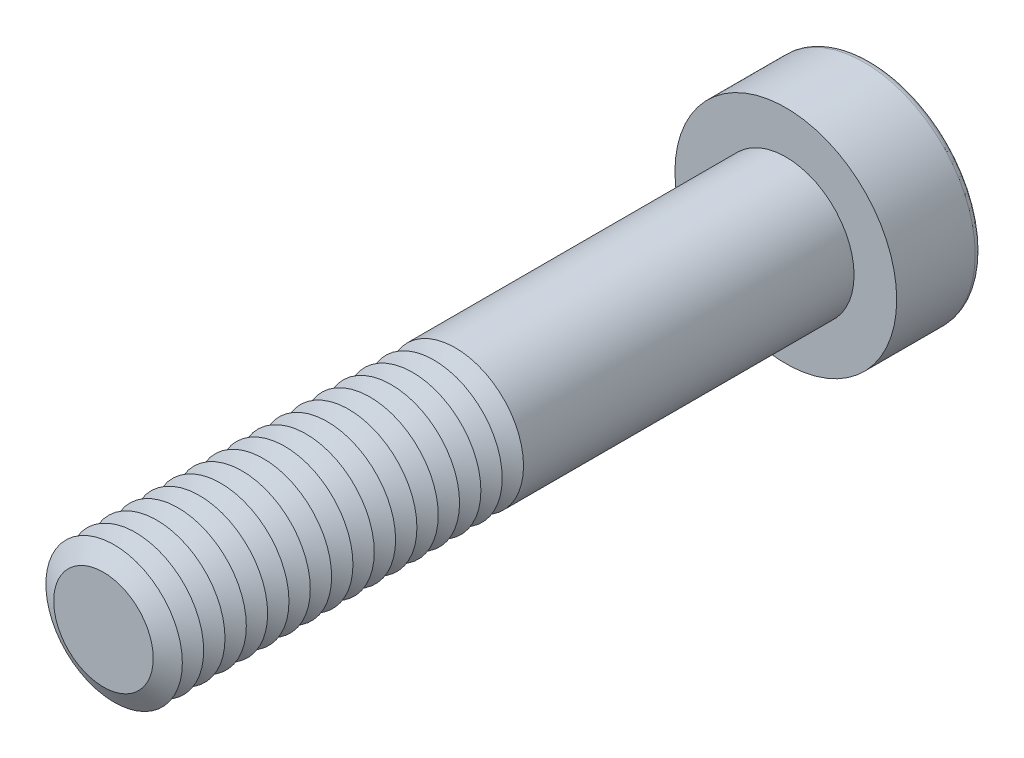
ISO-10303-21;
HEADER;
FILE_DESCRIPTION(('STEP AP214'),'2;1');
FILE_NAME('part.step','',(''),(''),'','','');
FILE_SCHEMA(('AUTOMOTIVE_DESIGN { 1 0 10303 214 1 1 1 1 }'));
ENDSEC;
DATA;
#1=APPLICATION_CONTEXT('core data for automotive mechanical design processes');
#2=APPLICATION_PROTOCOL_DEFINITION('international standard','automotive_design',2000,#1);
#3=PRODUCT_CONTEXT('',#1,'mechanical');
#4=PRODUCT('Part','Part','',(#3));
#5=PRODUCT_RELATED_PRODUCT_CATEGORY('part','',(#4));
#6=PRODUCT_DEFINITION_FORMATION('','',#4);
#7=PRODUCT_DEFINITION_CONTEXT('part definition',#1,'design');
#8=PRODUCT_DEFINITION('design','',#6,#7);
#9=PRODUCT_DEFINITION_SHAPE('','',#8);
#10=(LENGTH_UNIT() NAMED_UNIT(*) SI_UNIT(.MILLI.,.METRE.));
#11=(NAMED_UNIT(*) PLANE_ANGLE_UNIT() SI_UNIT($,.RADIAN.));
#12=(NAMED_UNIT(*) SI_UNIT($,.STERADIAN.) SOLID_ANGLE_UNIT());
#13=UNCERTAINTY_MEASURE_WITH_UNIT(LENGTH_MEASURE(1.E-05),#10,'distance_accuracy_value','');
#14=(GEOMETRIC_REPRESENTATION_CONTEXT(3) GLOBAL_UNCERTAINTY_ASSIGNED_CONTEXT((#13)) GLOBAL_UNIT_ASSIGNED_CONTEXT((#10,
#11,#12)) REPRESENTATION_CONTEXT('',''));
#15=CARTESIAN_POINT('',(0.,0.,0.));
#16=DIRECTION('',(0.,0.,1.));
#17=DIRECTION('',(1.,0.,0.));
#18=AXIS2_PLACEMENT_3D('',#15,#16,#17);
#19=CARTESIAN_POINT('',(0.,0.,35.625));
#20=DIRECTION('',(0.,0.,1.));
#21=DIRECTION('',(1.,0.,0.));
#22=AXIS2_PLACEMENT_3D('',#19,#20,#21);
#23=CONICAL_SURFACE('',#22,4.,1.0471975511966);
#24=CARTESIAN_POINT('',(0.,0.,35.));
#25=DIRECTION('',(0.,0.,1.));
#26=DIRECTION('',(1.,0.,0.));
#27=AXIS2_PLACEMENT_3D('',#24,#25,#26);
#28=CIRCLE('',#27,2.91746824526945);
#29=CARTESIAN_POINT('',(2.91746824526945,0.,35.));
#30=VERTEX_POINT('',#29);
#31=EDGE_CURVE('E312',#30,#30,#28,.T.);
#32=ORIENTED_EDGE('',*,*,#31,.T.);
#33=EDGE_LOOP('',(#32));
#34=FACE_BOUND('',#33,.T.);
#35=CARTESIAN_POINT('',(0.,0.,35.625));
#36=DIRECTION('',(0.,0.,1.));
#37=DIRECTION('',(1.,0.,0.));
#38=AXIS2_PLACEMENT_3D('',#35,#36,#37);
#39=CIRCLE('',#38,4.);
#40=CARTESIAN_POINT('',(4.,0.,35.625));
#41=VERTEX_POINT('',#40);
#42=EDGE_CURVE('E315',#41,#41,#39,.T.);
#43=ORIENTED_EDGE('',*,*,#42,.F.);
#44=EDGE_LOOP('',(#43));
#45=FACE_BOUND('',#44,.T.);
#46=ADVANCED_FACE('F39',(#34,#45),#23,.T.);
#47=CARTESIAN_POINT('',(0.,0.,35.));
#48=DIRECTION('',(0.,0.,-1.));
#49=DIRECTION('',(-1.,0.,0.));
#50=AXIS2_PLACEMENT_3D('',#47,#48,#49);
#51=CONICAL_SURFACE('',#50,2.91746824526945,1.0471975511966);
#52=CARTESIAN_POINT('',(0.,0.,34.375));
#53=DIRECTION('',(0.,0.,1.));
#54=DIRECTION('',(1.,0.,0.));
#55=AXIS2_PLACEMENT_3D('',#52,#53,#54);
#56=CIRCLE('',#55,4.);
#57=CARTESIAN_POINT('',(4.,0.,34.375));
#58=VERTEX_POINT('',#57);
#59=EDGE_CURVE('E323',#58,#58,#56,.T.);
#60=ORIENTED_EDGE('',*,*,#59,.T.);
#61=EDGE_LOOP('',(#60));
#62=FACE_BOUND('',#61,.T.);
#63=ORIENTED_EDGE('',*,*,#31,.F.);
#64=EDGE_LOOP('',(#63));
#65=FACE_BOUND('',#64,.T.);
#66=ADVANCED_FACE('F245',(#62,#65),#51,.T.);
#67=CARTESIAN_POINT('',(0.,0.,40.));
#68=DIRECTION('',(0.,0.,1.));
#69=DIRECTION('',(1.,0.,0.));
#70=AXIS2_PLACEMENT_3D('',#67,#68,#69);
#71=PLANE('',#70);
#72=CARTESIAN_POINT('',(0.,0.,40.));
#73=DIRECTION('',(0.,0.,1.));
#74=DIRECTION('',(1.,0.,0.));
#75=AXIS2_PLACEMENT_3D('',#72,#73,#74);
#76=CIRCLE('',#75,2.91746824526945);
#77=CARTESIAN_POINT('',(2.91746824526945,0.,40.));
#78=VERTEX_POINT('',#77);
#79=EDGE_CURVE('E174',#78,#78,#76,.T.);
#80=ORIENTED_EDGE('',*,*,#79,.T.);
#81=EDGE_LOOP('',(#80));
#82=FACE_BOUND('',#81,.T.);
#83=ADVANCED_FACE('F251',(#82),#71,.T.);
#84=CARTESIAN_POINT('',(0.,0.,40.));
#85=DIRECTION('',(0.,0.,-1.));
#86=DIRECTION('',(-1.,0.,0.));
#87=AXIS2_PLACEMENT_3D('',#84,#85,#86);
#88=CONICAL_SURFACE('',#87,2.91746824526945,1.0471975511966);
#89=CARTESIAN_POINT('',(0.,0.,39.375));
#90=DIRECTION('',(0.,0.,1.));
#91=DIRECTION('',(1.,0.,0.));
#92=AXIS2_PLACEMENT_3D('',#89,#90,#91);
#93=CIRCLE('',#92,4.);
#94=CARTESIAN_POINT('',(4.,0.,39.375));
#95=VERTEX_POINT('',#94);
#96=EDGE_CURVE('E291',#95,#95,#93,.T.);
#97=ORIENTED_EDGE('',*,*,#96,.T.);
#98=EDGE_LOOP('',(#97));
#99=FACE_BOUND('',#98,.T.);
#100=ORIENTED_EDGE('',*,*,#79,.F.);
#101=EDGE_LOOP('',(#100));
#102=FACE_BOUND('',#101,.T.);
#103=ADVANCED_FACE('F199',(#99,#102),#88,.T.);
#104=CARTESIAN_POINT('',(0.,0.,39.375));
#105=DIRECTION('',(0.,0.,1.));
#106=DIRECTION('',(1.,0.,0.));
#107=AXIS2_PLACEMENT_3D('',#104,#105,#106);
#108=CONICAL_SURFACE('',#107,4.,1.0471975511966);
#109=CARTESIAN_POINT('',(0.,0.,38.75));
#110=DIRECTION('',(0.,0.,1.));
#111=DIRECTION('',(1.,0.,0.));
#112=AXIS2_PLACEMENT_3D('',#109,#110,#111);
#113=CIRCLE('',#112,2.91746824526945);
#114=CARTESIAN_POINT('',(2.91746824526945,0.,38.75));
#115=VERTEX_POINT('',#114);
#116=EDGE_CURVE('E288',#115,#115,#113,.T.);
#117=ORIENTED_EDGE('',*,*,#116,.T.);
#118=EDGE_LOOP('',(#117));
#119=FACE_BOUND('',#118,.T.);
#120=ORIENTED_EDGE('',*,*,#96,.F.);
#121=EDGE_LOOP('',(#120));
#122=FACE_BOUND('',#121,.T.);
#123=ADVANCED_FACE('F277',(#119,#122),#108,.T.);
#124=CARTESIAN_POINT('',(0.,0.,38.75));
#125=DIRECTION('',(0.,0.,-1.));
#126=DIRECTION('',(-1.,0.,0.));
#127=AXIS2_PLACEMENT_3D('',#124,#125,#126);
#128=CONICAL_SURFACE('',#127,2.91746824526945,1.0471975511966);
#129=CARTESIAN_POINT('',(0.,0.,38.125));
#130=DIRECTION('',(0.,0.,1.));
#131=DIRECTION('',(1.,0.,0.));
#132=AXIS2_PLACEMENT_3D('',#129,#130,#131);
#133=CIRCLE('',#132,4.);
#134=CARTESIAN_POINT('',(4.,0.,38.125));
#135=VERTEX_POINT('',#134);
#136=EDGE_CURVE('E299',#135,#135,#133,.T.);
#137=ORIENTED_EDGE('',*,*,#136,.T.);
#138=EDGE_LOOP('',(#137));
#139=FACE_BOUND('',#138,.T.);
#140=ORIENTED_EDGE('',*,*,#116,.F.);
#141=EDGE_LOOP('',(#140));
#142=FACE_BOUND('',#141,.T.);
#143=ADVANCED_FACE('F274',(#139,#142),#128,.T.);
#144=CARTESIAN_POINT('',(0.,0.,38.125));
#145=DIRECTION('',(0.,0.,1.));
#146=DIRECTION('',(1.,0.,0.));
#147=AXIS2_PLACEMENT_3D('',#144,#145,#146);
#148=CONICAL_SURFACE('',#147,4.,1.0471975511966);
#149=CARTESIAN_POINT('',(0.,0.,37.5));
#150=DIRECTION('',(0.,0.,1.));
#151=DIRECTION('',(1.,0.,0.));
#152=AXIS2_PLACEMENT_3D('',#149,#150,#151);
#153=CIRCLE('',#152,2.91746824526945);
#154=CARTESIAN_POINT('',(2.91746824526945,0.,37.5));
#155=VERTEX_POINT('',#154);
#156=EDGE_CURVE('E293',#155,#155,#153,.T.);
#157=ORIENTED_EDGE('',*,*,#156,.T.);
#158=EDGE_LOOP('',(#157));
#159=FACE_BOUND('',#158,.T.);
#160=ORIENTED_EDGE('',*,*,#136,.F.);
#161=EDGE_LOOP('',(#160));
#162=FACE_BOUND('',#161,.T.);
#163=ADVANCED_FACE('F270',(#159,#162),#148,.T.);
#164=CARTESIAN_POINT('',(0.,0.,37.5));
#165=DIRECTION('',(0.,0.,-1.));
#166=DIRECTION('',(-1.,0.,0.));
#167=AXIS2_PLACEMENT_3D('',#164,#165,#166);
#168=CONICAL_SURFACE('',#167,2.91746824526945,1.0471975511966);
#169=CARTESIAN_POINT('',(0.,0.,36.875));
#170=DIRECTION('',(0.,0.,1.));
#171=DIRECTION('',(1.,0.,0.));
#172=AXIS2_PLACEMENT_3D('',#169,#170,#171);
#173=CIRCLE('',#172,4.);
#174=CARTESIAN_POINT('',(4.,0.,36.875));
#175=VERTEX_POINT('',#174);
#176=EDGE_CURVE('E309',#175,#175,#173,.T.);
#177=ORIENTED_EDGE('',*,*,#176,.T.);
#178=EDGE_LOOP('',(#177));
#179=FACE_BOUND('',#178,.T.);
#180=ORIENTED_EDGE('',*,*,#156,.F.);
#181=EDGE_LOOP('',(#180));
#182=FACE_BOUND('',#181,.T.);
#183=ADVANCED_FACE('F266',(#179,#182),#168,.T.);
#184=CARTESIAN_POINT('',(0.,0.,36.875));
#185=DIRECTION('',(0.,0.,1.));
#186=DIRECTION('',(1.,0.,0.));
#187=AXIS2_PLACEMENT_3D('',#184,#185,#186);
#188=CONICAL_SURFACE('',#187,4.,1.0471975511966);
#189=CARTESIAN_POINT('',(0.,0.,36.25));
#190=DIRECTION('',(0.,0.,1.));
#191=DIRECTION('',(1.,0.,0.));
#192=AXIS2_PLACEMENT_3D('',#189,#190,#191);
#193=CIRCLE('',#192,2.91746824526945);
#194=CARTESIAN_POINT('',(2.91746824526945,0.,36.25));
#195=VERTEX_POINT('',#194);
#196=EDGE_CURVE('E305',#195,#195,#193,.T.);
#197=ORIENTED_EDGE('',*,*,#196,.T.);
#198=EDGE_LOOP('',(#197));
#199=FACE_BOUND('',#198,.T.);
#200=ORIENTED_EDGE('',*,*,#176,.F.);
#201=EDGE_LOOP('',(#200));
#202=FACE_BOUND('',#201,.T.);
#203=ADVANCED_FACE('F262',(#199,#202),#188,.T.);
#204=CARTESIAN_POINT('',(0.,0.,36.25));
#205=DIRECTION('',(0.,0.,-1.));
#206=DIRECTION('',(-1.,0.,0.));
#207=AXIS2_PLACEMENT_3D('',#204,#205,#206);
#208=CONICAL_SURFACE('',#207,2.91746824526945,1.0471975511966);
#209=ORIENTED_EDGE('',*,*,#42,.T.);
#210=EDGE_LOOP('',(#209));
#211=FACE_BOUND('',#210,.T.);
#212=ORIENTED_EDGE('',*,*,#196,.F.);
#213=EDGE_LOOP('',(#212));
#214=FACE_BOUND('',#213,.T.);
#215=ADVANCED_FACE('F258',(#211,#214),#208,.T.);
#216=CARTESIAN_POINT('',(0.,0.,34.375));
#217=DIRECTION('',(0.,0.,1.));
#218=DIRECTION('',(1.,0.,0.));
#219=AXIS2_PLACEMENT_3D('',#216,#217,#218);
#220=CONICAL_SURFACE('',#219,4.,1.0471975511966);
#221=CARTESIAN_POINT('',(0.,0.,33.75));
#222=DIRECTION('',(0.,0.,1.));
#223=DIRECTION('',(1.,0.,0.));
#224=AXIS2_PLACEMENT_3D('',#221,#222,#223);
#225=CIRCLE('',#224,2.91746824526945);
#226=CARTESIAN_POINT('',(2.91746824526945,0.,33.75));
#227=VERTEX_POINT('',#226);
#228=EDGE_CURVE('E319',#227,#227,#225,.T.);
#229=ORIENTED_EDGE('',*,*,#228,.T.);
#230=EDGE_LOOP('',(#229));
#231=FACE_BOUND('',#230,.T.);
#232=ORIENTED_EDGE('',*,*,#59,.F.);
#233=EDGE_LOOP('',(#232));
#234=FACE_BOUND('',#233,.T.);
#235=ADVANCED_FACE('F261',(#231,#234),#220,.T.);
#236=CARTESIAN_POINT('',(0.,0.,33.75));
#237=DIRECTION('',(0.,0.,-1.));
#238=DIRECTION('',(-1.,0.,0.));
#239=AXIS2_PLACEMENT_3D('',#236,#237,#238);
#240=CONICAL_SURFACE('',#239,2.91746824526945,1.0471975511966);
#241=CARTESIAN_POINT('',(0.,0.,33.125));
#242=DIRECTION('',(0.,0.,1.));
#243=DIRECTION('',(1.,0.,0.));
#244=AXIS2_PLACEMENT_3D('',#241,#242,#243);
#245=CIRCLE('',#244,4.);
#246=CARTESIAN_POINT('',(4.,0.,33.125));
#247=VERTEX_POINT('',#246);
#248=EDGE_CURVE('E331',#247,#247,#245,.T.);
#249=ORIENTED_EDGE('',*,*,#248,.T.);
#250=EDGE_LOOP('',(#249));
#251=FACE_BOUND('',#250,.T.);
#252=ORIENTED_EDGE('',*,*,#228,.F.);
#253=EDGE_LOOP('',(#252));
#254=FACE_BOUND('',#253,.T.);
#255=ADVANCED_FACE('F511',(#251,#254),#240,.T.);
#256=CARTESIAN_POINT('',(0.,0.,33.125));
#257=DIRECTION('',(0.,0.,1.));
#258=DIRECTION('',(1.,0.,0.));
#259=AXIS2_PLACEMENT_3D('',#256,#257,#258);
#260=CONICAL_SURFACE('',#259,4.,1.0471975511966);
#261=CARTESIAN_POINT('',(0.,0.,32.5));
#262=DIRECTION('',(0.,0.,1.));
#263=DIRECTION('',(1.,0.,0.));
#264=AXIS2_PLACEMENT_3D('',#261,#262,#263);
#265=CIRCLE('',#264,2.91746824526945);
#266=CARTESIAN_POINT('',(2.91746824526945,0.,32.5));
#267=VERTEX_POINT('',#266);
#268=EDGE_CURVE('E327',#267,#267,#265,.T.);
#269=ORIENTED_EDGE('',*,*,#268,.T.);
#270=EDGE_LOOP('',(#269));
#271=FACE_BOUND('',#270,.T.);
#272=ORIENTED_EDGE('',*,*,#248,.F.);
#273=EDGE_LOOP('',(#272));
#274=FACE_BOUND('',#273,.T.);
#275=ADVANCED_FACE('F507',(#271,#274),#260,.T.);
#276=CARTESIAN_POINT('',(0.,0.,32.5));
#277=DIRECTION('',(0.,0.,-1.));
#278=DIRECTION('',(-1.,0.,0.));
#279=AXIS2_PLACEMENT_3D('',#276,#277,#278);
#280=CONICAL_SURFACE('',#279,2.91746824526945,1.0471975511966);
#281=CARTESIAN_POINT('',(0.,0.,31.875));
#282=DIRECTION('',(0.,0.,1.));
#283=DIRECTION('',(1.,0.,0.));
#284=AXIS2_PLACEMENT_3D('',#281,#282,#283);
#285=CIRCLE('',#284,4.);
#286=CARTESIAN_POINT('',(4.,0.,31.875));
#287=VERTEX_POINT('',#286);
#288=EDGE_CURVE('E338',#287,#287,#285,.T.);
#289=ORIENTED_EDGE('',*,*,#288,.T.);
#290=EDGE_LOOP('',(#289));
#291=FACE_BOUND('',#290,.T.);
#292=ORIENTED_EDGE('',*,*,#268,.F.);
#293=EDGE_LOOP('',(#292));
#294=FACE_BOUND('',#293,.T.);
#295=ADVANCED_FACE('F503',(#291,#294),#280,.T.);
#296=CARTESIAN_POINT('',(0.,0.,31.875));
#297=DIRECTION('',(0.,0.,1.));
#298=DIRECTION('',(1.,0.,0.));
#299=AXIS2_PLACEMENT_3D('',#296,#297,#298);
#300=CONICAL_SURFACE('',#299,4.,1.0471975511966);
#301=CARTESIAN_POINT('',(0.,0.,31.25));
#302=DIRECTION('',(0.,0.,1.));
#303=DIRECTION('',(1.,0.,0.));
#304=AXIS2_PLACEMENT_3D('',#301,#302,#303);
#305=CIRCLE('',#304,2.91746824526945);
#306=CARTESIAN_POINT('',(2.91746824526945,0.,31.25));
#307=VERTEX_POINT('',#306);
#308=EDGE_CURVE('E334',#307,#307,#305,.T.);
#309=ORIENTED_EDGE('',*,*,#308,.T.);
#310=EDGE_LOOP('',(#309));
#311=FACE_BOUND('',#310,.T.);
#312=ORIENTED_EDGE('',*,*,#288,.F.);
#313=EDGE_LOOP('',(#312));
#314=FACE_BOUND('',#313,.T.);
#315=ADVANCED_FACE('F499',(#311,#314),#300,.T.);
#316=CARTESIAN_POINT('',(0.,0.,31.25));
#317=DIRECTION('',(0.,0.,-1.));
#318=DIRECTION('',(-1.,0.,0.));
#319=AXIS2_PLACEMENT_3D('',#316,#317,#318);
#320=CONICAL_SURFACE('',#319,2.91746824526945,1.0471975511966);
#321=CARTESIAN_POINT('',(0.,0.,30.625));
#322=DIRECTION('',(0.,0.,1.));
#323=DIRECTION('',(1.,0.,0.));
#324=AXIS2_PLACEMENT_3D('',#321,#322,#323);
#325=CIRCLE('',#324,4.);
#326=CARTESIAN_POINT('',(4.,0.,30.625));
#327=VERTEX_POINT('',#326);
#328=EDGE_CURVE('E346',#327,#327,#325,.T.);
#329=ORIENTED_EDGE('',*,*,#328,.T.);
#330=EDGE_LOOP('',(#329));
#331=FACE_BOUND('',#330,.T.);
#332=ORIENTED_EDGE('',*,*,#308,.F.);
#333=EDGE_LOOP('',(#332));
#334=FACE_BOUND('',#333,.T.);
#335=ADVANCED_FACE('F495',(#331,#334),#320,.T.);
#336=CARTESIAN_POINT('',(0.,0.,30.625));
#337=DIRECTION('',(0.,0.,1.));
#338=DIRECTION('',(1.,0.,0.));
#339=AXIS2_PLACEMENT_3D('',#336,#337,#338);
#340=CONICAL_SURFACE('',#339,4.,1.0471975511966);
#341=CARTESIAN_POINT('',(0.,0.,30.));
#342=DIRECTION('',(0.,0.,1.));
#343=DIRECTION('',(1.,0.,0.));
#344=AXIS2_PLACEMENT_3D('',#341,#342,#343);
#345=CIRCLE('',#344,2.91746824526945);
#346=CARTESIAN_POINT('',(2.91746824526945,0.,30.));
#347=VERTEX_POINT('',#346);
#348=EDGE_CURVE('E342',#347,#347,#345,.T.);
#349=ORIENTED_EDGE('',*,*,#348,.T.);
#350=EDGE_LOOP('',(#349));
#351=FACE_BOUND('',#350,.T.);
#352=ORIENTED_EDGE('',*,*,#328,.F.);
#353=EDGE_LOOP('',(#352));
#354=FACE_BOUND('',#353,.T.);
#355=ADVANCED_FACE('F491',(#351,#354),#340,.T.);
#356=CARTESIAN_POINT('',(0.,0.,30.));
#357=DIRECTION('',(0.,0.,-1.));
#358=DIRECTION('',(-1.,0.,0.));
#359=AXIS2_PLACEMENT_3D('',#356,#357,#358);
#360=CONICAL_SURFACE('',#359,2.91746824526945,1.0471975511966);
#361=CARTESIAN_POINT('',(0.,0.,29.375));
#362=DIRECTION('',(0.,0.,1.));
#363=DIRECTION('',(1.,0.,0.));
#364=AXIS2_PLACEMENT_3D('',#361,#362,#363);
#365=CIRCLE('',#364,4.);
#366=CARTESIAN_POINT('',(4.,0.,29.375));
#367=VERTEX_POINT('',#366);
#368=EDGE_CURVE('E354',#367,#367,#365,.T.);
#369=ORIENTED_EDGE('',*,*,#368,.T.);
#370=EDGE_LOOP('',(#369));
#371=FACE_BOUND('',#370,.T.);
#372=ORIENTED_EDGE('',*,*,#348,.F.);
#373=EDGE_LOOP('',(#372));
#374=FACE_BOUND('',#373,.T.);
#375=ADVANCED_FACE('F487',(#371,#374),#360,.T.);
#376=CARTESIAN_POINT('',(0.,0.,29.375));
#377=DIRECTION('',(0.,0.,1.));
#378=DIRECTION('',(1.,0.,0.));
#379=AXIS2_PLACEMENT_3D('',#376,#377,#378);
#380=CONICAL_SURFACE('',#379,4.,1.0471975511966);
#381=CARTESIAN_POINT('',(0.,0.,28.75));
#382=DIRECTION('',(0.,0.,1.));
#383=DIRECTION('',(1.,0.,0.));
#384=AXIS2_PLACEMENT_3D('',#381,#382,#383);
#385=CIRCLE('',#384,2.91746824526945);
#386=CARTESIAN_POINT('',(2.91746824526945,0.,28.75));
#387=VERTEX_POINT('',#386);
#388=EDGE_CURVE('E350',#387,#387,#385,.T.);
#389=ORIENTED_EDGE('',*,*,#388,.T.);
#390=EDGE_LOOP('',(#389));
#391=FACE_BOUND('',#390,.T.);
#392=ORIENTED_EDGE('',*,*,#368,.F.);
#393=EDGE_LOOP('',(#392));
#394=FACE_BOUND('',#393,.T.);
#395=ADVANCED_FACE('F483',(#391,#394),#380,.T.);
#396=CARTESIAN_POINT('',(0.,0.,28.75));
#397=DIRECTION('',(0.,0.,-1.));
#398=DIRECTION('',(-1.,0.,0.));
#399=AXIS2_PLACEMENT_3D('',#396,#397,#398);
#400=CONICAL_SURFACE('',#399,2.91746824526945,1.0471975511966);
#401=CARTESIAN_POINT('',(0.,0.,28.125));
#402=DIRECTION('',(0.,0.,1.));
#403=DIRECTION('',(1.,0.,0.));
#404=AXIS2_PLACEMENT_3D('',#401,#402,#403);
#405=CIRCLE('',#404,4.);
#406=CARTESIAN_POINT('',(4.,0.,28.125));
#407=VERTEX_POINT('',#406);
#408=EDGE_CURVE('E362',#407,#407,#405,.T.);
#409=ORIENTED_EDGE('',*,*,#408,.T.);
#410=EDGE_LOOP('',(#409));
#411=FACE_BOUND('',#410,.T.);
#412=ORIENTED_EDGE('',*,*,#388,.F.);
#413=EDGE_LOOP('',(#412));
#414=FACE_BOUND('',#413,.T.);
#415=ADVANCED_FACE('F479',(#411,#414),#400,.T.);
#416=CARTESIAN_POINT('',(0.,0.,28.125));
#417=DIRECTION('',(0.,0.,1.));
#418=DIRECTION('',(1.,0.,0.));
#419=AXIS2_PLACEMENT_3D('',#416,#417,#418);
#420=CONICAL_SURFACE('',#419,4.,1.0471975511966);
#421=CARTESIAN_POINT('',(0.,0.,27.5));
#422=DIRECTION('',(0.,0.,1.));
#423=DIRECTION('',(1.,0.,0.));
#424=AXIS2_PLACEMENT_3D('',#421,#422,#423);
#425=CIRCLE('',#424,2.91746824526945);
#426=CARTESIAN_POINT('',(2.91746824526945,0.,27.5));
#427=VERTEX_POINT('',#426);
#428=EDGE_CURVE('E358',#427,#427,#425,.T.);
#429=ORIENTED_EDGE('',*,*,#428,.T.);
#430=EDGE_LOOP('',(#429));
#431=FACE_BOUND('',#430,.T.);
#432=ORIENTED_EDGE('',*,*,#408,.F.);
#433=EDGE_LOOP('',(#432));
#434=FACE_BOUND('',#433,.T.);
#435=ADVANCED_FACE('F475',(#431,#434),#420,.T.);
#436=CARTESIAN_POINT('',(0.,0.,27.5));
#437=DIRECTION('',(0.,0.,-1.));
#438=DIRECTION('',(-1.,0.,0.));
#439=AXIS2_PLACEMENT_3D('',#436,#437,#438);
#440=CONICAL_SURFACE('',#439,2.91746824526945,1.0471975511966);
#441=CARTESIAN_POINT('',(0.,0.,26.875));
#442=DIRECTION('',(0.,0.,1.));
#443=DIRECTION('',(1.,0.,0.));
#444=AXIS2_PLACEMENT_3D('',#441,#442,#443);
#445=CIRCLE('',#444,4.);
#446=CARTESIAN_POINT('',(4.,0.,26.875));
#447=VERTEX_POINT('',#446);
#448=EDGE_CURVE('E370',#447,#447,#445,.T.);
#449=ORIENTED_EDGE('',*,*,#448,.T.);
#450=EDGE_LOOP('',(#449));
#451=FACE_BOUND('',#450,.T.);
#452=ORIENTED_EDGE('',*,*,#428,.F.);
#453=EDGE_LOOP('',(#452));
#454=FACE_BOUND('',#453,.T.);
#455=ADVANCED_FACE('F471',(#451,#454),#440,.T.);
#456=CARTESIAN_POINT('',(0.,0.,26.875));
#457=DIRECTION('',(0.,0.,1.));
#458=DIRECTION('',(1.,0.,0.));
#459=AXIS2_PLACEMENT_3D('',#456,#457,#458);
#460=CONICAL_SURFACE('',#459,4.,1.0471975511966);
#461=CARTESIAN_POINT('',(0.,0.,26.25));
#462=DIRECTION('',(0.,0.,1.));
#463=DIRECTION('',(1.,0.,0.));
#464=AXIS2_PLACEMENT_3D('',#461,#462,#463);
#465=CIRCLE('',#464,2.91746824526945);
#466=CARTESIAN_POINT('',(2.91746824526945,0.,26.25));
#467=VERTEX_POINT('',#466);
#468=EDGE_CURVE('E366',#467,#467,#465,.T.);
#469=ORIENTED_EDGE('',*,*,#468,.T.);
#470=EDGE_LOOP('',(#469));
#471=FACE_BOUND('',#470,.T.);
#472=ORIENTED_EDGE('',*,*,#448,.F.);
#473=EDGE_LOOP('',(#472));
#474=FACE_BOUND('',#473,.T.);
#475=ADVANCED_FACE('F467',(#471,#474),#460,.T.);
#476=CARTESIAN_POINT('',(0.,0.,26.25));
#477=DIRECTION('',(0.,0.,-1.));
#478=DIRECTION('',(-1.,0.,0.));
#479=AXIS2_PLACEMENT_3D('',#476,#477,#478);
#480=CONICAL_SURFACE('',#479,2.91746824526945,1.0471975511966);
#481=CARTESIAN_POINT('',(0.,0.,25.625));
#482=DIRECTION('',(0.,0.,1.));
#483=DIRECTION('',(1.,0.,0.));
#484=AXIS2_PLACEMENT_3D('',#481,#482,#483);
#485=CIRCLE('',#484,4.);
#486=CARTESIAN_POINT('',(4.,0.,25.625));
#487=VERTEX_POINT('',#486);
#488=EDGE_CURVE('E378',#487,#487,#485,.T.);
#489=ORIENTED_EDGE('',*,*,#488,.T.);
#490=EDGE_LOOP('',(#489));
#491=FACE_BOUND('',#490,.T.);
#492=ORIENTED_EDGE('',*,*,#468,.F.);
#493=EDGE_LOOP('',(#492));
#494=FACE_BOUND('',#493,.T.);
#495=ADVANCED_FACE('F463',(#491,#494),#480,.T.);
#496=CARTESIAN_POINT('',(0.,0.,25.625));
#497=DIRECTION('',(0.,0.,1.));
#498=DIRECTION('',(1.,0.,0.));
#499=AXIS2_PLACEMENT_3D('',#496,#497,#498);
#500=CONICAL_SURFACE('',#499,4.,1.0471975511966);
#501=CARTESIAN_POINT('',(0.,0.,25.));
#502=DIRECTION('',(0.,0.,1.));
#503=DIRECTION('',(1.,0.,0.));
#504=AXIS2_PLACEMENT_3D('',#501,#502,#503);
#505=CIRCLE('',#504,2.91746824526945);
#506=CARTESIAN_POINT('',(2.91746824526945,0.,25.));
#507=VERTEX_POINT('',#506);
#508=EDGE_CURVE('E374',#507,#507,#505,.T.);
#509=ORIENTED_EDGE('',*,*,#508,.T.);
#510=EDGE_LOOP('',(#509));
#511=FACE_BOUND('',#510,.T.);
#512=ORIENTED_EDGE('',*,*,#488,.F.);
#513=EDGE_LOOP('',(#512));
#514=FACE_BOUND('',#513,.T.);
#515=ADVANCED_FACE('F459',(#511,#514),#500,.T.);
#516=CARTESIAN_POINT('',(0.,0.,25.));
#517=DIRECTION('',(0.,0.,-1.));
#518=DIRECTION('',(-1.,0.,0.));
#519=AXIS2_PLACEMENT_3D('',#516,#517,#518);
#520=CONICAL_SURFACE('',#519,2.91746824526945,1.0471975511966);
#521=CARTESIAN_POINT('',(0.,0.,24.375));
#522=DIRECTION('',(0.,0.,1.));
#523=DIRECTION('',(1.,0.,0.));
#524=AXIS2_PLACEMENT_3D('',#521,#522,#523);
#525=CIRCLE('',#524,4.);
#526=CARTESIAN_POINT('',(4.,0.,24.375));
#527=VERTEX_POINT('',#526);
#528=EDGE_CURVE('E386',#527,#527,#525,.T.);
#529=ORIENTED_EDGE('',*,*,#528,.T.);
#530=EDGE_LOOP('',(#529));
#531=FACE_BOUND('',#530,.T.);
#532=ORIENTED_EDGE('',*,*,#508,.F.);
#533=EDGE_LOOP('',(#532));
#534=FACE_BOUND('',#533,.T.);
#535=ADVANCED_FACE('F455',(#531,#534),#520,.T.);
#536=CARTESIAN_POINT('',(0.,0.,24.375));
#537=DIRECTION('',(0.,0.,1.));
#538=DIRECTION('',(1.,0.,0.));
#539=AXIS2_PLACEMENT_3D('',#536,#537,#538);
#540=CONICAL_SURFACE('',#539,4.,1.0471975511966);
#541=CARTESIAN_POINT('',(0.,0.,23.75));
#542=DIRECTION('',(0.,0.,1.));
#543=DIRECTION('',(1.,0.,0.));
#544=AXIS2_PLACEMENT_3D('',#541,#542,#543);
#545=CIRCLE('',#544,2.91746824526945);
#546=CARTESIAN_POINT('',(2.91746824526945,0.,23.75));
#547=VERTEX_POINT('',#546);
#548=EDGE_CURVE('E382',#547,#547,#545,.T.);
#549=ORIENTED_EDGE('',*,*,#548,.T.);
#550=EDGE_LOOP('',(#549));
#551=FACE_BOUND('',#550,.T.);
#552=ORIENTED_EDGE('',*,*,#528,.F.);
#553=EDGE_LOOP('',(#552));
#554=FACE_BOUND('',#553,.T.);
#555=ADVANCED_FACE('F451',(#551,#554),#540,.T.);
#556=CARTESIAN_POINT('',(0.,0.,23.75));
#557=DIRECTION('',(0.,0.,-1.));
#558=DIRECTION('',(-1.,0.,0.));
#559=AXIS2_PLACEMENT_3D('',#556,#557,#558);
#560=CONICAL_SURFACE('',#559,2.91746824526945,1.0471975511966);
#561=CARTESIAN_POINT('',(0.,0.,23.125));
#562=DIRECTION('',(0.,0.,1.));
#563=DIRECTION('',(1.,0.,0.));
#564=AXIS2_PLACEMENT_3D('',#561,#562,#563);
#565=CIRCLE('',#564,4.);
#566=CARTESIAN_POINT('',(4.,0.,23.125));
#567=VERTEX_POINT('',#566);
#568=EDGE_CURVE('E394',#567,#567,#565,.T.);
#569=ORIENTED_EDGE('',*,*,#568,.T.);
#570=EDGE_LOOP('',(#569));
#571=FACE_BOUND('',#570,.T.);
#572=ORIENTED_EDGE('',*,*,#548,.F.);
#573=EDGE_LOOP('',(#572));
#574=FACE_BOUND('',#573,.T.);
#575=ADVANCED_FACE('F447',(#571,#574),#560,.T.);
#576=CARTESIAN_POINT('',(0.,0.,23.125));
#577=DIRECTION('',(0.,0.,1.));
#578=DIRECTION('',(1.,0.,0.));
#579=AXIS2_PLACEMENT_3D('',#576,#577,#578);
#580=CONICAL_SURFACE('',#579,4.,1.0471975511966);
#581=CARTESIAN_POINT('',(0.,0.,22.5));
#582=DIRECTION('',(0.,0.,1.));
#583=DIRECTION('',(1.,0.,0.));
#584=AXIS2_PLACEMENT_3D('',#581,#582,#583);
#585=CIRCLE('',#584,2.91746824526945);
#586=CARTESIAN_POINT('',(2.91746824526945,0.,22.5));
#587=VERTEX_POINT('',#586);
#588=EDGE_CURVE('E390',#587,#587,#585,.T.);
#589=ORIENTED_EDGE('',*,*,#588,.T.);
#590=EDGE_LOOP('',(#589));
#591=FACE_BOUND('',#590,.T.);
#592=ORIENTED_EDGE('',*,*,#568,.F.);
#593=EDGE_LOOP('',(#592));
#594=FACE_BOUND('',#593,.T.);
#595=ADVANCED_FACE('F443',(#591,#594),#580,.T.);
#596=CARTESIAN_POINT('',(0.,0.,22.5));
#597=DIRECTION('',(0.,0.,-1.));
#598=DIRECTION('',(-1.,0.,0.));
#599=AXIS2_PLACEMENT_3D('',#596,#597,#598);
#600=CONICAL_SURFACE('',#599,2.91746824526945,1.0471975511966);
#601=CARTESIAN_POINT('',(0.,0.,21.875));
#602=DIRECTION('',(0.,0.,1.));
#603=DIRECTION('',(1.,0.,0.));
#604=AXIS2_PLACEMENT_3D('',#601,#602,#603);
#605=CIRCLE('',#604,4.);
#606=CARTESIAN_POINT('',(4.,0.,21.875));
#607=VERTEX_POINT('',#606);
#608=EDGE_CURVE('E402',#607,#607,#605,.T.);
#609=ORIENTED_EDGE('',*,*,#608,.T.);
#610=EDGE_LOOP('',(#609));
#611=FACE_BOUND('',#610,.T.);
#612=ORIENTED_EDGE('',*,*,#588,.F.);
#613=EDGE_LOOP('',(#612));
#614=FACE_BOUND('',#613,.T.);
#615=ADVANCED_FACE('F439',(#611,#614),#600,.T.);
#616=CARTESIAN_POINT('',(0.,0.,21.875));
#617=DIRECTION('',(0.,0.,1.));
#618=DIRECTION('',(1.,0.,0.));
#619=AXIS2_PLACEMENT_3D('',#616,#617,#618);
#620=CONICAL_SURFACE('',#619,4.,1.0471975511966);
#621=CARTESIAN_POINT('',(0.,0.,21.25));
#622=DIRECTION('',(0.,0.,1.));
#623=DIRECTION('',(1.,0.,0.));
#624=AXIS2_PLACEMENT_3D('',#621,#622,#623);
#625=CIRCLE('',#624,2.91746824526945);
#626=CARTESIAN_POINT('',(2.91746824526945,0.,21.25));
#627=VERTEX_POINT('',#626);
#628=EDGE_CURVE('E398',#627,#627,#625,.T.);
#629=ORIENTED_EDGE('',*,*,#628,.T.);
#630=EDGE_LOOP('',(#629));
#631=FACE_BOUND('',#630,.T.);
#632=ORIENTED_EDGE('',*,*,#608,.F.);
#633=EDGE_LOOP('',(#632));
#634=FACE_BOUND('',#633,.T.);
#635=ADVANCED_FACE('F434',(#631,#634),#620,.T.);
#636=CARTESIAN_POINT('',(0.,0.,21.25));
#637=DIRECTION('',(0.,0.,-1.));
#638=DIRECTION('',(-1.,0.,0.));
#639=AXIS2_PLACEMENT_3D('',#636,#637,#638);
#640=CONICAL_SURFACE('',#639,2.91746824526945,1.0471975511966);
#641=CARTESIAN_POINT('',(0.,0.,20.625));
#642=DIRECTION('',(0.,0.,1.));
#643=DIRECTION('',(1.,0.,0.));
#644=AXIS2_PLACEMENT_3D('',#641,#642,#643);
#645=CIRCLE('',#644,4.);
#646=CARTESIAN_POINT('',(4.,0.,20.625));
#647=VERTEX_POINT('',#646);
#648=EDGE_CURVE('E414',#647,#647,#645,.T.);
#649=ORIENTED_EDGE('',*,*,#648,.T.);
#650=EDGE_LOOP('',(#649));
#651=FACE_BOUND('',#650,.T.);
#652=ORIENTED_EDGE('',*,*,#628,.F.);
#653=EDGE_LOOP('',(#652));
#654=FACE_BOUND('',#653,.T.);
#655=ADVANCED_FACE('F420',(#651,#654),#640,.T.);
#656=CARTESIAN_POINT('',(0.,0.,20.625));
#657=DIRECTION('',(0.,0.,1.));
#658=DIRECTION('',(1.,0.,0.));
#659=AXIS2_PLACEMENT_3D('',#656,#657,#658);
#660=CONICAL_SURFACE('',#659,4.,1.0471975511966);
#661=CARTESIAN_POINT('',(0.,0.,20.));
#662=DIRECTION('',(0.,0.,1.));
#663=DIRECTION('',(1.,0.,0.));
#664=AXIS2_PLACEMENT_3D('',#661,#662,#663);
#665=CIRCLE('',#664,2.91746824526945);
#666=CARTESIAN_POINT('',(2.91746824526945,0.,20.));
#667=VERTEX_POINT('',#666);
#668=EDGE_CURVE('E406',#667,#667,#665,.T.);
#669=ORIENTED_EDGE('',*,*,#668,.T.);
#670=EDGE_LOOP('',(#669));
#671=FACE_BOUND('',#670,.T.);
#672=ORIENTED_EDGE('',*,*,#648,.F.);
#673=EDGE_LOOP('',(#672));
#674=FACE_BOUND('',#673,.T.);
#675=ADVANCED_FACE('F423',(#671,#674),#660,.T.);
#676=CARTESIAN_POINT('',(0.,0.,20.));
#677=DIRECTION('',(0.,0.,-1.));
#678=DIRECTION('',(-1.,0.,0.));
#679=AXIS2_PLACEMENT_3D('',#676,#677,#678);
#680=CONICAL_SURFACE('',#679,2.91746824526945,1.0471975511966);
#681=CARTESIAN_POINT('',(0.,0.,19.375));
#682=DIRECTION('',(0.,0.,1.));
#683=DIRECTION('',(1.,0.,0.));
#684=AXIS2_PLACEMENT_3D('',#681,#682,#683);
#685=CIRCLE('',#684,4.);
#686=CARTESIAN_POINT('',(4.,0.,19.375));
#687=VERTEX_POINT('',#686);
#688=EDGE_CURVE('E410',#687,#687,#685,.T.);
#689=ORIENTED_EDGE('',*,*,#688,.T.);
#690=EDGE_LOOP('',(#689));
#691=FACE_BOUND('',#690,.T.);
#692=ORIENTED_EDGE('',*,*,#668,.F.);
#693=EDGE_LOOP('',(#692));
#694=FACE_BOUND('',#693,.T.);
#695=ADVANCED_FACE('F425',(#691,#694),#680,.T.);
#696=CARTESIAN_POINT('',(0.,0.,-1.25));
#697=DIRECTION('',(0.,0.,-1.));
#698=DIRECTION('',(-1.,0.,0.));
#699=AXIS2_PLACEMENT_3D('',#696,#697,#698);
#700=CONICAL_SURFACE('',#699,2.5,1.0471975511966);
#701=CARTESIAN_POINT('',(0.,0.,0.193375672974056));
#702=VERTEX_POINT('',#701);
#703=VERTEX_LOOP('',#702);
#704=FACE_BOUND('',#703,.T.);
#705=CARTESIAN_POINT('',(0.,0.,-1.25));
#706=DIRECTION('',(0.,0.,-1.));
#707=DIRECTION('',(-1.,0.,0.));
#708=AXIS2_PLACEMENT_3D('',#705,#706,#707);
#709=CIRCLE('',#708,2.5);
#710=CARTESIAN_POINT('',(-2.1650635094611,1.25,-1.25));
#711=VERTEX_POINT('',#710);
#712=CARTESIAN_POINT('',(0.,2.5,-1.25));
#713=VERTEX_POINT('',#712);
#714=EDGE_CURVE('E149',#711,#713,#709,.T.);
#715=ORIENTED_EDGE('',*,*,#714,.T.);
#716=CARTESIAN_POINT('',(0.,0.,-1.25));
#717=DIRECTION('',(0.,0.,-1.));
#718=DIRECTION('',(-1.,0.,0.));
#719=AXIS2_PLACEMENT_3D('',#716,#717,#718);
#720=CIRCLE('',#719,2.5);
#721=CARTESIAN_POINT('',(2.1650635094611,1.25,-1.25));
#722=VERTEX_POINT('',#721);
#723=EDGE_CURVE('E54',#713,#722,#720,.T.);
#724=ORIENTED_EDGE('',*,*,#723,.T.);
#725=CARTESIAN_POINT('',(2.1650635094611,-1.25,-1.25));
#726=VERTEX_POINT('',#725);
#727=EDGE_CURVE('E1025',#722,#726,#720,.T.);
#728=ORIENTED_EDGE('',*,*,#727,.T.);
#729=CARTESIAN_POINT('',(0.,-2.5,-1.25));
#730=VERTEX_POINT('',#729);
#731=EDGE_CURVE('E1023',#726,#730,#720,.T.);
#732=ORIENTED_EDGE('',*,*,#731,.T.);
#733=CARTESIAN_POINT('',(-2.1650635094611,-1.25,-1.25));
#734=VERTEX_POINT('',#733);
#735=EDGE_CURVE('E1018',#730,#734,#720,.T.);
#736=ORIENTED_EDGE('',*,*,#735,.T.);
#737=EDGE_CURVE('E1016',#734,#711,#720,.T.);
#738=ORIENTED_EDGE('',*,*,#737,.T.);
#739=EDGE_LOOP('',(#715,#724,#728,#732,#736,#738));
#740=FACE_BOUND('',#739,.T.);
#741=ADVANCED_FACE('F201',(#704,#740),#700,.F.);
#742=CARTESIAN_POINT('',(0.,0.,-1.25));
#743=DIRECTION('',(0.,0.,-1.));
#744=DIRECTION('',(-1.,0.,0.));
#745=AXIS2_PLACEMENT_3D('',#742,#743,#744);
#746=PLANE('',#745);
#747=ORIENTED_EDGE('',*,*,#723,.F.);
#748=DIRECTION('',(1.,0.,0.));
#749=VECTOR('',#748,1.);
#750=CARTESIAN_POINT('',(-1.44337567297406,2.5,-1.25));
#751=LINE('',#750,#749);
#752=CARTESIAN_POINT('',(1.44337567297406,2.5,-1.25));
#753=VERTEX_POINT('',#752);
#754=EDGE_CURVE('E1065',#713,#753,#751,.T.);
#755=ORIENTED_EDGE('',*,*,#754,.T.);
#756=DIRECTION('',(0.5,-0.866025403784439,0.));
#757=VECTOR('',#756,1.);
#758=CARTESIAN_POINT('',(1.44337567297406,2.5,-1.25));
#759=LINE('',#758,#757);
#760=EDGE_CURVE('E155',#753,#722,#759,.T.);
#761=ORIENTED_EDGE('',*,*,#760,.T.);
#762=EDGE_LOOP('',(#747,#755,#761));
#763=FACE_BOUND('',#762,.T.);
#764=ADVANCED_FACE('F606',(#763),#746,.T.);
#765=ORIENTED_EDGE('',*,*,#727,.F.);
#766=CARTESIAN_POINT('',(2.88675134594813,0.,-1.25));
#767=VERTEX_POINT('',#766);
#768=EDGE_CURVE('E1064',#722,#767,#759,.T.);
#769=ORIENTED_EDGE('',*,*,#768,.T.);
#770=DIRECTION('',(-0.5,-0.866025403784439,0.));
#771=VECTOR('',#770,1.);
#772=CARTESIAN_POINT('',(2.88675134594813,0.,-1.25));
#773=LINE('',#772,#771);
#774=EDGE_CURVE('E1039',#767,#726,#773,.T.);
#775=ORIENTED_EDGE('',*,*,#774,.T.);
#776=EDGE_LOOP('',(#765,#769,#775));
#777=FACE_BOUND('',#776,.T.);
#778=ADVANCED_FACE('F616',(#777),#746,.T.);
#779=ORIENTED_EDGE('',*,*,#731,.F.);
#780=CARTESIAN_POINT('',(1.44337567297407,-2.5,-1.25));
#781=VERTEX_POINT('',#780);
#782=EDGE_CURVE('E1041',#726,#781,#773,.T.);
#783=ORIENTED_EDGE('',*,*,#782,.T.);
#784=DIRECTION('',(-1.,0.,0.));
#785=VECTOR('',#784,1.);
#786=CARTESIAN_POINT('',(1.44337567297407,-2.5,-1.25));
#787=LINE('',#786,#785);
#788=EDGE_CURVE('E991',#781,#730,#787,.T.);
#789=ORIENTED_EDGE('',*,*,#788,.T.);
#790=EDGE_LOOP('',(#779,#783,#789));
#791=FACE_BOUND('',#790,.T.);
#792=ADVANCED_FACE('F626',(#791),#746,.T.);
#793=ORIENTED_EDGE('',*,*,#735,.F.);
#794=CARTESIAN_POINT('',(-1.44337567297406,-2.5,-1.25));
#795=VERTEX_POINT('',#794);
#796=EDGE_CURVE('E1035',#730,#795,#787,.T.);
#797=ORIENTED_EDGE('',*,*,#796,.T.);
#798=DIRECTION('',(-0.5,0.866025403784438,0.));
#799=VECTOR('',#798,1.);
#800=CARTESIAN_POINT('',(-1.44337567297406,-2.5,-1.25));
#801=LINE('',#800,#799);
#802=EDGE_CURVE('E1037',#795,#734,#801,.T.);
#803=ORIENTED_EDGE('',*,*,#802,.T.);
#804=EDGE_LOOP('',(#793,#797,#803));
#805=FACE_BOUND('',#804,.T.);
#806=ADVANCED_FACE('F634',(#805),#746,.T.);
#807=ORIENTED_EDGE('',*,*,#737,.F.);
#808=CARTESIAN_POINT('',(-2.88675134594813,0.,-1.25));
#809=VERTEX_POINT('',#808);
#810=EDGE_CURVE('E1043',#734,#809,#801,.T.);
#811=ORIENTED_EDGE('',*,*,#810,.T.);
#812=DIRECTION('',(0.5,0.866025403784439,0.));
#813=VECTOR('',#812,1.);
#814=CARTESIAN_POINT('',(-2.88675134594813,0.,-1.25));
#815=LINE('',#814,#813);
#816=EDGE_CURVE('E158',#809,#711,#815,.T.);
#817=ORIENTED_EDGE('',*,*,#816,.T.);
#818=EDGE_LOOP('',(#807,#811,#817));
#819=FACE_BOUND('',#818,.T.);
#820=ADVANCED_FACE('F231',(#819),#746,.T.);
#821=ORIENTED_EDGE('',*,*,#714,.F.);
#822=CARTESIAN_POINT('',(-1.44337567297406,2.5,-1.25));
#823=VERTEX_POINT('',#822);
#824=EDGE_CURVE('E1050',#711,#823,#815,.T.);
#825=ORIENTED_EDGE('',*,*,#824,.T.);
#826=EDGE_CURVE('E1062',#823,#713,#751,.T.);
#827=ORIENTED_EDGE('',*,*,#826,.T.);
#828=EDGE_LOOP('',(#821,#825,#827));
#829=FACE_BOUND('',#828,.T.);
#830=ADVANCED_FACE('F618',(#829),#746,.T.);
#831=CARTESIAN_POINT('',(-1.44337567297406,2.5,-1.25));
#832=DIRECTION('',(0.,1.,0.));
#833=DIRECTION('',(-1.,0.,0.));
#834=AXIS2_PLACEMENT_3D('',#831,#832,#833);
#835=PLANE('',#834);
#836=DIRECTION('',(0.,0.,-1.));
#837=VECTOR('',#836,1.);
#838=CARTESIAN_POINT('',(-1.44337567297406,2.5,-1.25));
#839=LINE('',#838,#837);
#840=CARTESIAN_POINT('',(-1.44337567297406,2.5,-5.));
#841=VERTEX_POINT('',#840);
#842=EDGE_CURVE('E147',#823,#841,#839,.T.);
#843=ORIENTED_EDGE('',*,*,#842,.T.);
#844=CARTESIAN_POINT('',(-3.76800948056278,2.5,-5.43814611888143));
#845=CARTESIAN_POINT('',(-3.65512241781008,2.5,-5.41294788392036));
#846=CARTESIAN_POINT('',(-3.54216337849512,2.5,-5.38806689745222));
#847=CARTESIAN_POINT('',(-3.31606595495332,2.5,-5.33910944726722));
#848=CARTESIAN_POINT('',(-3.202927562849,2.5,-5.31503301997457));
#849=CARTESIAN_POINT('',(-2.97632910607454,2.5,-5.26783262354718));
#850=CARTESIAN_POINT('',(-2.86286882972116,2.5,-5.24470966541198));
#851=CARTESIAN_POINT('',(-2.63570880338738,2.5,-5.19967851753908));
#852=CARTESIAN_POINT('',(-2.522009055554,2.5,-5.17777031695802));
#853=CARTESIAN_POINT('',(-2.18246936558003,2.5,-5.11464083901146));
#854=CARTESIAN_POINT('',(-1.95621666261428,2.5,-5.07559469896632));
#855=CARTESIAN_POINT('',(-1.50233128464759,2.5,-5.00642421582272));
#856=CARTESIAN_POINT('',(-1.27469889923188,2.5,-4.97629806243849));
#857=CARTESIAN_POINT('',(-0.930935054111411,2.5,-4.9407375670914));
#858=CARTESIAN_POINT('',(-0.815306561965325,2.5,-4.93045885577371));
#859=CARTESIAN_POINT('',(-0.583775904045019,2.5,-4.91374261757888));
#860=CARTESIAN_POINT('',(-0.467873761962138,2.5,-4.9073047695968));
#861=CARTESIAN_POINT('',(-0.235955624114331,2.5,-4.89864425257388));
#862=CARTESIAN_POINT('',(-0.119939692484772,2.5,-4.89641989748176));
#863=CARTESIAN_POINT('',(0.11209426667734,2.5,-4.89632233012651));
#864=CARTESIAN_POINT('',(0.228112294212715,2.5,-4.89844912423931));
#865=CARTESIAN_POINT('',(0.460464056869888,2.5,-4.90693624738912));
#866=CARTESIAN_POINT('',(0.576797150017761,2.5,-4.91331380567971));
#867=CARTESIAN_POINT('',(0.809186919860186,2.5,-4.92994602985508));
#868=CARTESIAN_POINT('',(0.925243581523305,2.5,-4.94020090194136));
#869=CARTESIAN_POINT('',(1.1570783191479,2.5,-4.96408095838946));
#870=CARTESIAN_POINT('',(1.27285617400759,2.5,-4.97770825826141));
#871=CARTESIAN_POINT('',(1.50403978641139,2.5,-5.0077859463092));
#872=CARTESIAN_POINT('',(1.61944554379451,2.5,-5.02423633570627));
#873=CARTESIAN_POINT('',(1.97116037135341,2.5,-5.07794848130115));
#874=CARTESIAN_POINT('',(2.20690405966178,2.5,-5.11889404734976));
#875=CARTESIAN_POINT('',(2.67723558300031,2.5,-5.2069642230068));
#876=CARTESIAN_POINT('',(2.9118232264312,2.5,-5.25408982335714));
#877=CARTESIAN_POINT('',(3.38022088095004,2.5,-5.35235327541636));
#878=CARTESIAN_POINT('',(3.61403064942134,2.5,-5.40349227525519));
#879=CARTESIAN_POINT('',(4.08105387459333,2.5,-5.50842823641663));
#880=CARTESIAN_POINT('',(4.31426731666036,2.5,-5.56222526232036));
#881=CARTESIAN_POINT('',(4.77742011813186,2.5,-5.67097662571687));
#882=CARTESIAN_POINT('',(5.00736469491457,2.5,-5.72590882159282));
#883=CARTESIAN_POINT('',(5.46695141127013,2.5,-5.83704335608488));
#884=CARTESIAN_POINT('',(5.69659354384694,2.5,-5.89324572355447));
#885=CARTESIAN_POINT('',(6.15532898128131,2.5,-6.00649703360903));
#886=CARTESIAN_POINT('',(6.3844226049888,2.5,-6.06354468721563));
#887=CARTESIAN_POINT('',(6.84242442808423,2.5,-6.17834514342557));
#888=CARTESIAN_POINT('',(7.07133263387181,2.5,-6.23609792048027));
#889=CARTESIAN_POINT('',(7.30017784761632,2.5,-6.29409642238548));
#890=B_SPLINE_CURVE_WITH_KNOTS('',3,(#844,#845,#846,#847,#848,#849,#850,#851,#852,#853,#854,
#855,#856,#857,#858,#859,#860,#861,#862,#863,#864,#865,#866,#867,#868,#869,#870,#871,#872,#873,
#874,#875,#876,#877,#878,#879,#880,#881,#882,#883,#884,#885,#886,#887,#888,#889),.UNSPECIFIED.,
.F.,.F.,(4,2,2,2,2,2,2,2,2,2,2,2,2,2,2,2,2,2,2,2,2,2,4),(0.,0.346996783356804,0.694009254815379,
1.04138068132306,1.38874900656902,2.07743762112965,2.76598637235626,3.11418615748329,
3.46235682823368,3.81038814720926,4.15841997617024,4.50787110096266,4.85734081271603,
5.2070303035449,5.55671994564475,6.27438533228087,6.99216591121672,7.71015258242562,
8.42815670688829,9.13739674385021,9.84665290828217,10.5549206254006,11.2631627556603),.UNSPECIFIED.);
#891=CARTESIAN_POINT('',(1.44337567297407,2.5,-5.));
#892=VERTEX_POINT('',#891);
#893=EDGE_CURVE('E124',#841,#892,#890,.T.);
#894=ORIENTED_EDGE('',*,*,#893,.T.);
#895=DIRECTION('',(0.,0.,-1.));
#896=VECTOR('',#895,1.);
#897=CARTESIAN_POINT('',(1.44337567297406,2.5,-1.25));
#898=LINE('',#897,#896);
#899=EDGE_CURVE('E143',#753,#892,#898,.T.);
#900=ORIENTED_EDGE('',*,*,#899,.F.);
#901=ORIENTED_EDGE('',*,*,#754,.F.);
#902=ORIENTED_EDGE('',*,*,#826,.F.);
#903=EDGE_LOOP('',(#843,#894,#900,#901,#902));
#904=FACE_BOUND('',#903,.T.);
#905=ADVANCED_FACE('F141',(#904),#835,.F.);
#906=CARTESIAN_POINT('',(1.44337567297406,2.5,-1.25));
#907=DIRECTION('',(0.866025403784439,0.5,0.));
#908=DIRECTION('',(-0.5,0.866025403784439,0.));
#909=AXIS2_PLACEMENT_3D('',#906,#907,#908);
#910=PLANE('',#909);
#911=ORIENTED_EDGE('',*,*,#899,.T.);
#912=CARTESIAN_POINT('',(1.44326020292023,2.5002,-5.00003094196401));
#913=CARTESIAN_POINT('',(1.50320952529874,2.3963647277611,-4.98395956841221));
#914=CARTESIAN_POINT('',(1.56326755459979,2.29234116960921,-4.96936932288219));
#915=CARTESIAN_POINT('',(1.68359574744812,2.08392662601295,-4.94373552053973));
#916=CARTESIAN_POINT('',(1.7438659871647,1.97953550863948,-4.93269340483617));
#917=CARTESIAN_POINT('',(1.86425311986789,1.77101887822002,-4.91480059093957));
#918=CARTESIAN_POINT('',(1.9243691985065,1.66689477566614,-4.90792855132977));
#919=CARTESIAN_POINT('',(2.04467803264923,1.45851376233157,-4.89871383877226));
#920=CARTESIAN_POINT('',(2.10487077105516,1.35425688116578,-4.89637028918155));
#921=CARTESIAN_POINT('',(2.22525624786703,1.14574311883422,-4.89637028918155));
#922=CARTESIAN_POINT('',(2.28544898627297,1.04148623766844,-4.89871383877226));
#923=CARTESIAN_POINT('',(2.40575782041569,0.833105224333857,-4.90792855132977));
#924=CARTESIAN_POINT('',(2.4658738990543,0.728981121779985,-4.91480059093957));
#925=CARTESIAN_POINT('',(2.58626103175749,0.520464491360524,-4.93269340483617));
#926=CARTESIAN_POINT('',(2.64653127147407,0.416073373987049,-4.94373552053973));
#927=CARTESIAN_POINT('',(2.7668594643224,0.207658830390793,-4.96936932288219));
#928=CARTESIAN_POINT('',(2.82691749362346,0.103635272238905,-4.98395956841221));
#929=CARTESIAN_POINT('',(2.88686681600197,-0.000199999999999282,-5.00003094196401));
#930=B_SPLINE_CURVE_WITH_KNOTS('',3,(#912,#913,#914,#915,#916,#917,#918,#919,#920,#921,#922,
#923,#924,#925,#926,#927,#928,#929),.UNSPECIFIED.,.F.,.F.,(4,2,2,2,2,2,2,2,4),(0.,
0.362931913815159,0.726011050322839,1.08721601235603,1.44835104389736,1.80948607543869,
2.17069103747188,2.53377017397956,2.89670208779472),.UNSPECIFIED.);
#931=CARTESIAN_POINT('',(2.88675134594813,0.,-5.));
#932=VERTEX_POINT('',#931);
#933=EDGE_CURVE('E11',#892,#932,#930,.T.);
#934=ORIENTED_EDGE('',*,*,#933,.T.);
#935=DIRECTION('',(0.,0.,-1.));
#936=VECTOR('',#935,1.);
#937=CARTESIAN_POINT('',(2.88675134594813,0.,-1.25));
#938=LINE('',#937,#936);
#939=EDGE_CURVE('E157',#767,#932,#938,.T.);
#940=ORIENTED_EDGE('',*,*,#939,.F.);
#941=ORIENTED_EDGE('',*,*,#768,.F.);
#942=ORIENTED_EDGE('',*,*,#760,.F.);
#943=EDGE_LOOP('',(#911,#934,#940,#941,#942));
#944=FACE_BOUND('',#943,.T.);
#945=ADVANCED_FACE('F152',(#944),#910,.F.);
#946=CARTESIAN_POINT('',(2.88675134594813,0.,-1.25));
#947=DIRECTION('',(0.866025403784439,-0.5,0.));
#948=DIRECTION('',(0.5,0.866025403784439,0.));
#949=AXIS2_PLACEMENT_3D('',#946,#947,#948);
#950=PLANE('',#949);
#951=ORIENTED_EDGE('',*,*,#939,.T.);
#952=CARTESIAN_POINT('',(2.88686681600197,0.000200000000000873,-5.00003094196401));
#953=CARTESIAN_POINT('',(2.82691749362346,-0.103635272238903,-4.98395956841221));
#954=CARTESIAN_POINT('',(2.7668594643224,-0.207658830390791,-4.96936932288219));
#955=CARTESIAN_POINT('',(2.64653127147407,-0.416073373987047,-4.94373552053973));
#956=CARTESIAN_POINT('',(2.58626103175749,-0.520464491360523,-4.93269340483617));
#957=CARTESIAN_POINT('',(2.4658738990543,-0.728981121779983,-4.91480059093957));
#958=CARTESIAN_POINT('',(2.40575782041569,-0.833105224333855,-4.90792855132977));
#959=CARTESIAN_POINT('',(2.28544898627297,-1.04148623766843,-4.89871383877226));
#960=CARTESIAN_POINT('',(2.22525624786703,-1.14574311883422,-4.89637028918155));
#961=CARTESIAN_POINT('',(2.10487077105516,-1.35425688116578,-4.89637028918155));
#962=CARTESIAN_POINT('',(2.04467803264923,-1.45851376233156,-4.89871383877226));
#963=CARTESIAN_POINT('',(1.9243691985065,-1.66689477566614,-4.90792855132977));
#964=CARTESIAN_POINT('',(1.86425311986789,-1.77101887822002,-4.91480059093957));
#965=CARTESIAN_POINT('',(1.74386598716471,-1.97953550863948,-4.93269340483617));
#966=CARTESIAN_POINT('',(1.68359574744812,-2.08392662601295,-4.94373552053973));
#967=CARTESIAN_POINT('',(1.56326755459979,-2.29234116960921,-4.96936932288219));
#968=CARTESIAN_POINT('',(1.50320952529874,-2.3963647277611,-4.98395956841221));
#969=CARTESIAN_POINT('',(1.44326020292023,-2.5002,-5.00003094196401));
#970=B_SPLINE_CURVE_WITH_KNOTS('',3,(#952,#953,#954,#955,#956,#957,#958,#959,#960,#961,#962,
#963,#964,#965,#966,#967,#968,#969),.UNSPECIFIED.,.F.,.F.,(4,2,2,2,2,2,2,2,4),(0.,
0.362931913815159,0.726011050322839,1.08721601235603,1.44835104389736,1.80948607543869,
2.17069103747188,2.53377017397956,2.89670208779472),.UNSPECIFIED.);
#971=CARTESIAN_POINT('',(1.44337567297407,-2.5,-5.));
#972=VERTEX_POINT('',#971);
#973=EDGE_CURVE('E173',#932,#972,#970,.T.);
#974=ORIENTED_EDGE('',*,*,#973,.T.);
#975=DIRECTION('',(0.,0.,-1.));
#976=VECTOR('',#975,1.);
#977=CARTESIAN_POINT('',(1.44337567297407,-2.5,-1.25));
#978=LINE('',#977,#976);
#979=EDGE_CURVE('E986',#781,#972,#978,.T.);
#980=ORIENTED_EDGE('',*,*,#979,.F.);
#981=ORIENTED_EDGE('',*,*,#782,.F.);
#982=ORIENTED_EDGE('',*,*,#774,.F.);
#983=EDGE_LOOP('',(#951,#974,#980,#981,#982));
#984=FACE_BOUND('',#983,.T.);
#985=ADVANCED_FACE('F191',(#984),#950,.F.);
#986=CARTESIAN_POINT('',(1.44337567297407,-2.5,-1.25));
#987=DIRECTION('',(0.,-1.,0.));
#988=DIRECTION('',(1.,0.,0.));
#989=AXIS2_PLACEMENT_3D('',#986,#987,#988);
#990=PLANE('',#989);
#991=ORIENTED_EDGE('',*,*,#979,.T.);
#992=CARTESIAN_POINT('',(-3.76800948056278,-2.5,-5.43814611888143));
#993=CARTESIAN_POINT('',(-3.65512241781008,-2.5,-5.41294788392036));
#994=CARTESIAN_POINT('',(-3.54216337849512,-2.5,-5.38806689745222));
#995=CARTESIAN_POINT('',(-3.31606595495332,-2.5,-5.33910944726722));
#996=CARTESIAN_POINT('',(-3.202927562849,-2.5,-5.31503301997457));
#997=CARTESIAN_POINT('',(-2.97632910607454,-2.5,-5.26783262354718));
#998=CARTESIAN_POINT('',(-2.86286882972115,-2.5,-5.24470966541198));
#999=CARTESIAN_POINT('',(-2.63570880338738,-2.5,-5.19967851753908));
#1000=CARTESIAN_POINT('',(-2.522009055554,-2.5,-5.17777031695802));
#1001=CARTESIAN_POINT('',(-2.18246936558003,-2.5,-5.11464083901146));
#1002=CARTESIAN_POINT('',(-1.95621666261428,-2.5,-5.07559469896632));
#1003=CARTESIAN_POINT('',(-1.50233128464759,-2.5,-5.00642421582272));
#1004=CARTESIAN_POINT('',(-1.27469889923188,-2.5,-4.97629806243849));
#1005=CARTESIAN_POINT('',(-0.930935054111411,-2.5,-4.9407375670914));
#1006=CARTESIAN_POINT('',(-0.815306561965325,-2.5,-4.93045885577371));
#1007=CARTESIAN_POINT('',(-0.583775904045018,-2.5,-4.91374261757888));
#1008=CARTESIAN_POINT('',(-0.467873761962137,-2.5,-4.9073047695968));
#1009=CARTESIAN_POINT('',(-0.23595562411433,-2.5,-4.89864425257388));
#1010=CARTESIAN_POINT('',(-0.119939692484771,-2.5,-4.89641989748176));
#1011=CARTESIAN_POINT('',(0.112094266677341,-2.5,-4.89632233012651));
#1012=CARTESIAN_POINT('',(0.228112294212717,-2.5,-4.89844912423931));
#1013=CARTESIAN_POINT('',(0.460464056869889,-2.5,-4.90693624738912));
#1014=CARTESIAN_POINT('',(0.576797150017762,-2.5,-4.91331380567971));
#1015=CARTESIAN_POINT('',(0.809186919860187,-2.5,-4.92994602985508));
#1016=CARTESIAN_POINT('',(0.925243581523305,-2.5,-4.94020090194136));
#1017=CARTESIAN_POINT('',(1.1570783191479,-2.5,-4.96408095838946));
#1018=CARTESIAN_POINT('',(1.27285617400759,-2.5,-4.97770825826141));
#1019=CARTESIAN_POINT('',(1.50403978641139,-2.5,-5.0077859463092));
#1020=CARTESIAN_POINT('',(1.61944554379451,-2.5,-5.02423633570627));
#1021=CARTESIAN_POINT('',(1.97116037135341,-2.5,-5.07794848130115));
#1022=CARTESIAN_POINT('',(2.20690405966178,-2.5,-5.11889404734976));
#1023=CARTESIAN_POINT('',(2.67723558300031,-2.5,-5.2069642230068));
#1024=CARTESIAN_POINT('',(2.9118232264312,-2.5,-5.25408982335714));
#1025=CARTESIAN_POINT('',(3.38022088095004,-2.5,-5.35235327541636));
#1026=CARTESIAN_POINT('',(3.61403064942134,-2.5,-5.40349227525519));
#1027=CARTESIAN_POINT('',(4.08105387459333,-2.5,-5.50842823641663));
#1028=CARTESIAN_POINT('',(4.31426731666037,-2.5,-5.56222526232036));
#1029=CARTESIAN_POINT('',(4.77742011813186,-2.5,-5.67097662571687));
#1030=CARTESIAN_POINT('',(5.00736469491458,-2.5,-5.72590882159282));
#1031=CARTESIAN_POINT('',(5.46695141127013,-2.5,-5.83704335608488));
#1032=CARTESIAN_POINT('',(5.69659354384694,-2.5,-5.89324572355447));
#1033=CARTESIAN_POINT('',(6.15532898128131,-2.5,-6.00649703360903));
#1034=CARTESIAN_POINT('',(6.38442260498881,-2.5,-6.06354468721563));
#1035=CARTESIAN_POINT('',(6.84242442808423,-2.5,-6.17834514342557));
#1036=CARTESIAN_POINT('',(7.07133263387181,-2.5,-6.23609792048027));
#1037=CARTESIAN_POINT('',(7.30017784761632,-2.5,-6.29409642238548));
#1038=B_SPLINE_CURVE_WITH_KNOTS('',3,(#992,#993,#994,#995,#996,#997,#998,#999,#1000,#1001,#1002,
#1003,#1004,#1005,#1006,#1007,#1008,#1009,#1010,#1011,#1012,#1013,#1014,#1015,#1016,#1017,#1018,
#1019,#1020,#1021,#1022,#1023,#1024,#1025,#1026,#1027,#1028,#1029,#1030,#1031,#1032,#1033,#1034,
#1035,#1036,#1037),.UNSPECIFIED.,.F.,.F.,(4,2,2,2,2,2,2,2,2,2,2,2,2,2,2,2,2,2,2,2,2,2,4),(0.,
0.346996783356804,0.69400925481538,1.04138068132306,1.38874900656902,2.07743762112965,
2.76598637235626,3.11418615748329,3.46235682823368,3.81038814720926,4.15841997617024,
4.50787110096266,4.85734081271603,5.20703030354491,5.55671994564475,6.27438533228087,
6.99216591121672,7.71015258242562,8.42815670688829,9.13739674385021,9.84665290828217,
10.5549206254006,11.2631627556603),.UNSPECIFIED.);
#1039=CARTESIAN_POINT('',(-1.44337567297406,-2.5,-5.));
#1040=VERTEX_POINT('',#1039);
#1041=EDGE_CURVE('E184',#972,#1040,#1038,.F.);
#1042=ORIENTED_EDGE('',*,*,#1041,.T.);
#1043=DIRECTION('',(0.,0.,-1.));
#1044=VECTOR('',#1043,1.);
#1045=CARTESIAN_POINT('',(-1.44337567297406,-2.5,-1.25));
#1046=LINE('',#1045,#1044);
#1047=EDGE_CURVE('E993',#795,#1040,#1046,.T.);
#1048=ORIENTED_EDGE('',*,*,#1047,.F.);
#1049=ORIENTED_EDGE('',*,*,#796,.F.);
#1050=ORIENTED_EDGE('',*,*,#788,.F.);
#1051=EDGE_LOOP('',(#991,#1042,#1048,#1049,#1050));
#1052=FACE_BOUND('',#1051,.T.);
#1053=ADVANCED_FACE('F234',(#1052),#990,.F.);
#1054=CARTESIAN_POINT('',(-1.44337567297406,-2.5,-1.25));
#1055=DIRECTION('',(-0.866025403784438,-0.5,0.));
#1056=DIRECTION('',(0.5,-0.866025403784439,0.));
#1057=AXIS2_PLACEMENT_3D('',#1054,#1055,#1056);
#1058=PLANE('',#1057);
#1059=ORIENTED_EDGE('',*,*,#1047,.T.);
#1060=CARTESIAN_POINT('',(-1.44326020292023,-2.5002,-5.00003094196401));
#1061=CARTESIAN_POINT('',(-1.50320952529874,-2.3963647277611,-4.98395956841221));
#1062=CARTESIAN_POINT('',(-1.56326755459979,-2.29234116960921,-4.96936932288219));
#1063=CARTESIAN_POINT('',(-1.68359574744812,-2.08392662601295,-4.94373552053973));
#1064=CARTESIAN_POINT('',(-1.7438659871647,-1.97953550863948,-4.93269340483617));
#1065=CARTESIAN_POINT('',(-1.86425311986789,-1.77101887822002,-4.91480059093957));
#1066=CARTESIAN_POINT('',(-1.9243691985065,-1.66689477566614,-4.90792855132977));
#1067=CARTESIAN_POINT('',(-2.04467803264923,-1.45851376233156,-4.89871383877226));
#1068=CARTESIAN_POINT('',(-2.10487077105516,-1.35425688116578,-4.89637028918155));
#1069=CARTESIAN_POINT('',(-2.22525624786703,-1.14574311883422,-4.89637028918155));
#1070=CARTESIAN_POINT('',(-2.28544898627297,-1.04148623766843,-4.89871383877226));
#1071=CARTESIAN_POINT('',(-2.40575782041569,-0.833105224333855,-4.90792855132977));
#1072=CARTESIAN_POINT('',(-2.4658738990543,-0.728981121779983,-4.91480059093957));
#1073=CARTESIAN_POINT('',(-2.58626103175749,-0.520464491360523,-4.93269340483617));
#1074=CARTESIAN_POINT('',(-2.64653127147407,-0.416073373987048,-4.94373552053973));
#1075=CARTESIAN_POINT('',(-2.7668594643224,-0.207658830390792,-4.96936932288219));
#1076=CARTESIAN_POINT('',(-2.82691749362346,-0.103635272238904,-4.98395956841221));
#1077=CARTESIAN_POINT('',(-2.88686681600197,0.000199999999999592,-5.00003094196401));
#1078=B_SPLINE_CURVE_WITH_KNOTS('',3,(#1060,#1061,#1062,#1063,#1064,#1065,#1066,#1067,#1068,
#1069,#1070,#1071,#1072,#1073,#1074,#1075,#1076,#1077),.UNSPECIFIED.,.F.,.F.,(4,2,2,2,2,2,2,2,
4),(0.,0.362931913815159,0.726011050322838,1.08721601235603,1.44835104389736,1.80948607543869,
2.17069103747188,2.53377017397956,2.89670208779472),.UNSPECIFIED.);
#1079=CARTESIAN_POINT('',(-2.88675134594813,0.,-5.));
#1080=VERTEX_POINT('',#1079);
#1081=EDGE_CURVE('E208',#1040,#1080,#1078,.T.);
#1082=ORIENTED_EDGE('',*,*,#1081,.T.);
#1083=DIRECTION('',(0.,0.,-1.));
#1084=VECTOR('',#1083,1.);
#1085=CARTESIAN_POINT('',(-2.88675134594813,0.,-1.25));
#1086=LINE('',#1085,#1084);
#1087=EDGE_CURVE('E996',#809,#1080,#1086,.T.);
#1088=ORIENTED_EDGE('',*,*,#1087,.F.);
#1089=ORIENTED_EDGE('',*,*,#810,.F.);
#1090=ORIENTED_EDGE('',*,*,#802,.F.);
#1091=EDGE_LOOP('',(#1059,#1082,#1088,#1089,#1090));
#1092=FACE_BOUND('',#1091,.T.);
#1093=ADVANCED_FACE('F229',(#1092),#1058,.F.);
#1094=CARTESIAN_POINT('',(-2.88675134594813,0.,-1.25));
#1095=DIRECTION('',(-0.866025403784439,0.5,0.));
#1096=DIRECTION('',(-0.5,-0.866025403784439,0.));
#1097=AXIS2_PLACEMENT_3D('',#1094,#1095,#1096);
#1098=PLANE('',#1097);
#1099=ORIENTED_EDGE('',*,*,#1087,.T.);
#1100=CARTESIAN_POINT('',(-2.88686681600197,-0.000200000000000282,-5.00003094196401));
#1101=CARTESIAN_POINT('',(-2.82691749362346,0.103635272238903,-4.98395956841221));
#1102=CARTESIAN_POINT('',(-2.7668594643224,0.207658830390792,-4.96936932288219));
#1103=CARTESIAN_POINT('',(-2.64653127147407,0.416073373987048,-4.94373552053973));
#1104=CARTESIAN_POINT('',(-2.58626103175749,0.520464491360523,-4.93269340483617));
#1105=CARTESIAN_POINT('',(-2.4658738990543,0.728981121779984,-4.91480059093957));
#1106=CARTESIAN_POINT('',(-2.40575782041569,0.833105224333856,-4.90792855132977));
#1107=CARTESIAN_POINT('',(-2.28544898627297,1.04148623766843,-4.89871383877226));
#1108=CARTESIAN_POINT('',(-2.22525624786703,1.14574311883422,-4.89637028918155));
#1109=CARTESIAN_POINT('',(-2.10487077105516,1.35425688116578,-4.89637028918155));
#1110=CARTESIAN_POINT('',(-2.04467803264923,1.45851376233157,-4.89871383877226));
#1111=CARTESIAN_POINT('',(-1.9243691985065,1.66689477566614,-4.90792855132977));
#1112=CARTESIAN_POINT('',(-1.86425311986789,1.77101887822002,-4.91480059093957));
#1113=CARTESIAN_POINT('',(-1.7438659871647,1.97953550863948,-4.93269340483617));
#1114=CARTESIAN_POINT('',(-1.68359574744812,2.08392662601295,-4.94373552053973));
#1115=CARTESIAN_POINT('',(-1.56326755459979,2.29234116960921,-4.96936932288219));
#1116=CARTESIAN_POINT('',(-1.50320952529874,2.3963647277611,-4.98395956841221));
#1117=CARTESIAN_POINT('',(-1.44326020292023,2.5002,-5.00003094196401));
#1118=B_SPLINE_CURVE_WITH_KNOTS('',3,(#1100,#1101,#1102,#1103,#1104,#1105,#1106,#1107,#1108,
#1109,#1110,#1111,#1112,#1113,#1114,#1115,#1116,#1117),.UNSPECIFIED.,.F.,.F.,(4,2,2,2,2,2,2,2,
4),(0.,0.362931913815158,0.726011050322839,1.08721601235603,1.44835104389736,1.80948607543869,
2.17069103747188,2.53377017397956,2.89670208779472),.UNSPECIFIED.);
#1119=EDGE_CURVE('E150',#1080,#841,#1118,.T.);
#1120=ORIENTED_EDGE('',*,*,#1119,.T.);
#1121=ORIENTED_EDGE('',*,*,#842,.F.);
#1122=ORIENTED_EDGE('',*,*,#824,.F.);
#1123=ORIENTED_EDGE('',*,*,#816,.F.);
#1124=EDGE_LOOP('',(#1099,#1120,#1121,#1122,#1123));
#1125=FACE_BOUND('',#1124,.T.);
#1126=ADVANCED_FACE('F197',(#1125),#1098,.F.);
#1127=CARTESIAN_POINT('',(0.,0.,-5.));
#1128=DIRECTION('',(0.,0.,-1.));
#1129=DIRECTION('',(-1.,0.,0.));
#1130=AXIS2_PLACEMENT_3D('',#1127,#1128,#1129);
#1131=CONICAL_SURFACE('',#1130,2.88675134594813,1.30899693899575);
#1132=CARTESIAN_POINT('',(0.,0.,-5.));
#1133=DIRECTION('',(0.,0.,-1.));
#1134=DIRECTION('',(-1.,0.,0.));
#1135=AXIS2_PLACEMENT_3D('',#1132,#1133,#1134);
#1136=CIRCLE('',#1135,2.88675134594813);
#1137=EDGE_CURVE('E120',#841,#892,#1136,.T.);
#1138=ORIENTED_EDGE('',*,*,#1137,.T.);
#1139=ORIENTED_EDGE('',*,*,#893,.F.);
#1140=EDGE_LOOP('',(#1138,#1139));
#1141=FACE_BOUND('',#1140,.T.);
#1142=ADVANCED_FACE('F122',(#1141),#1131,.F.);
#1143=EDGE_CURVE('E129',#892,#932,#1136,.T.);
#1144=ORIENTED_EDGE('',*,*,#1143,.T.);
#1145=ORIENTED_EDGE('',*,*,#933,.F.);
#1146=EDGE_LOOP('',(#1144,#1145));
#1147=FACE_BOUND('',#1146,.T.);
#1148=ADVANCED_FACE('F133',(#1147),#1131,.F.);
#1149=EDGE_CURVE('E164',#932,#972,#1136,.T.);
#1150=ORIENTED_EDGE('',*,*,#1149,.T.);
#1151=ORIENTED_EDGE('',*,*,#973,.F.);
#1152=EDGE_LOOP('',(#1150,#1151));
#1153=FACE_BOUND('',#1152,.T.);
#1154=ADVANCED_FACE('F699',(#1153),#1131,.F.);
#1155=EDGE_CURVE('E169',#972,#1040,#1136,.T.);
#1156=ORIENTED_EDGE('',*,*,#1155,.T.);
#1157=ORIENTED_EDGE('',*,*,#1041,.F.);
#1158=EDGE_LOOP('',(#1156,#1157));
#1159=FACE_BOUND('',#1158,.T.);
#1160=ADVANCED_FACE('F706',(#1159),#1131,.F.);
#1161=EDGE_CURVE('E67',#1040,#1080,#1136,.T.);
#1162=ORIENTED_EDGE('',*,*,#1161,.T.);
#1163=ORIENTED_EDGE('',*,*,#1081,.F.);
#1164=EDGE_LOOP('',(#1162,#1163));
#1165=FACE_BOUND('',#1164,.T.);
#1166=ADVANCED_FACE('F714',(#1165),#1131,.F.);
#1167=EDGE_CURVE('E60',#1080,#841,#1136,.T.);
#1168=ORIENTED_EDGE('',*,*,#1167,.T.);
#1169=ORIENTED_EDGE('',*,*,#1119,.F.);
#1170=EDGE_LOOP('',(#1168,#1169));
#1171=FACE_BOUND('',#1170,.T.);
#1172=ADVANCED_FACE('F198',(#1171),#1131,.F.);
#1173=CARTESIAN_POINT('',(0.,0.,-5.));
#1174=DIRECTION('',(0.,0.,-1.));
#1175=DIRECTION('',(-1.,0.,0.));
#1176=AXIS2_PLACEMENT_3D('',#1173,#1174,#1175);
#1177=PLANE('',#1176);
#1178=ORIENTED_EDGE('',*,*,#1167,.F.);
#1179=ORIENTED_EDGE('',*,*,#1161,.F.);
#1180=ORIENTED_EDGE('',*,*,#1155,.F.);
#1181=ORIENTED_EDGE('',*,*,#1149,.F.);
#1182=ORIENTED_EDGE('',*,*,#1143,.F.);
#1183=ORIENTED_EDGE('',*,*,#1137,.F.);
#1184=EDGE_LOOP('',(#1178,#1179,#1180,#1181,#1182,#1183));
#1185=FACE_BOUND('',#1184,.T.);
#1186=CARTESIAN_POINT('',(0.,0.,-5.));
#1187=DIRECTION('',(0.,0.,-1.));
#1188=DIRECTION('',(-1.,0.,0.));
#1189=AXIS2_PLACEMENT_3D('',#1186,#1187,#1188);
#1190=CIRCLE('',#1189,6.1);
#1191=CARTESIAN_POINT('',(-6.1,0.,-5.));
#1192=VERTEX_POINT('',#1191);
#1193=EDGE_CURVE('E1009',#1192,#1192,#1190,.T.);
#1194=ORIENTED_EDGE('',*,*,#1193,.T.);
#1195=EDGE_LOOP('',(#1194));
#1196=FACE_BOUND('',#1195,.T.);
#1197=ADVANCED_FACE('F161',(#1185,#1196),#1177,.T.);
#1198=CARTESIAN_POINT('',(0.,0.,-4.6));
#1199=DIRECTION('',(0.,0.,-1.));
#1200=DIRECTION('',(-1.,0.,0.));
#1201=AXIS2_PLACEMENT_3D('',#1198,#1199,#1200);
#1202=TOROIDAL_SURFACE('',#1201,6.1,0.4);
#1203=CARTESIAN_POINT('',(0.,0.,-4.6));
#1204=DIRECTION('',(0.,0.,-1.));
#1205=DIRECTION('',(-1.,0.,0.));
#1206=AXIS2_PLACEMENT_3D('',#1203,#1204,#1205);
#1207=CIRCLE('',#1206,6.5);
#1208=CARTESIAN_POINT('',(-6.5,0.,-4.6));
#1209=VERTEX_POINT('',#1208);
#1210=EDGE_CURVE('E1013',#1209,#1209,#1207,.F.);
#1211=ORIENTED_EDGE('',*,*,#1210,.F.);
#1212=EDGE_LOOP('',(#1211));
#1213=FACE_BOUND('',#1212,.T.);
#1214=ORIENTED_EDGE('',*,*,#1193,.F.);
#1215=EDGE_LOOP('',(#1214));
#1216=FACE_BOUND('',#1215,.T.);
#1217=ADVANCED_FACE('F41',(#1213,#1216),#1202,.T.);
#1218=CARTESIAN_POINT('',(0.,0.,-5.));
#1219=DIRECTION('',(0.,0.,1.));
#1220=DIRECTION('',(1.,0.,0.));
#1221=AXIS2_PLACEMENT_3D('',#1218,#1219,#1220);
#1222=CYLINDRICAL_SURFACE('',#1221,6.5);
#1223=ORIENTED_EDGE('',*,*,#1210,.T.);
#1224=EDGE_LOOP('',(#1223));
#1225=FACE_BOUND('',#1224,.T.);
#1226=CARTESIAN_POINT('',(0.,0.,0.));
#1227=DIRECTION('',(0.,0.,-1.));
#1228=DIRECTION('',(-1.,0.,0.));
#1229=AXIS2_PLACEMENT_3D('',#1226,#1227,#1228);
#1230=CIRCLE('',#1229,6.5);
#1231=CARTESIAN_POINT('',(-6.5,0.,0.));
#1232=VERTEX_POINT('',#1231);
#1233=EDGE_CURVE('E1001',#1232,#1232,#1230,.T.);
#1234=ORIENTED_EDGE('',*,*,#1233,.T.);
#1235=EDGE_LOOP('',(#1234));
#1236=FACE_BOUND('',#1235,.T.);
#1237=ADVANCED_FACE('F738',(#1225,#1236),#1222,.T.);
#1238=CARTESIAN_POINT('',(0.,0.,0.));
#1239=DIRECTION('',(0.,0.,-1.));
#1240=DIRECTION('',(-1.,0.,0.));
#1241=AXIS2_PLACEMENT_3D('',#1238,#1239,#1240);
#1242=PLANE('',#1241);
#1243=CARTESIAN_POINT('',(0.,0.,0.));
#1244=DIRECTION('',(0.,0.,1.));
#1245=DIRECTION('',(1.,0.,0.));
#1246=AXIS2_PLACEMENT_3D('',#1243,#1244,#1245);
#1247=CIRCLE('',#1246,4.);
#1248=CARTESIAN_POINT('',(4.,0.,0.));
#1249=VERTEX_POINT('',#1248);
#1250=EDGE_CURVE('E1005',#1249,#1249,#1247,.T.);
#1251=ORIENTED_EDGE('',*,*,#1250,.F.);
#1252=EDGE_LOOP('',(#1251));
#1253=FACE_BOUND('',#1252,.T.);
#1254=ORIENTED_EDGE('',*,*,#1233,.F.);
#1255=EDGE_LOOP('',(#1254));
#1256=FACE_BOUND('',#1255,.T.);
#1257=ADVANCED_FACE('F746',(#1253,#1256),#1242,.F.);
#1258=CARTESIAN_POINT('',(0.,0.,40.));
#1259=DIRECTION('',(0.,0.,-1.));
#1260=DIRECTION('',(-1.,0.,0.));
#1261=AXIS2_PLACEMENT_3D('',#1258,#1259,#1260);
#1262=CYLINDRICAL_SURFACE('',#1261,4.);
#1263=ORIENTED_EDGE('',*,*,#1250,.T.);
#1264=EDGE_LOOP('',(#1263));
#1265=FACE_BOUND('',#1264,.T.);
#1266=ORIENTED_EDGE('',*,*,#688,.F.);
#1267=EDGE_LOOP('',(#1266));
#1268=FACE_BOUND('',#1267,.T.);
#1269=ADVANCED_FACE('F755',(#1265,#1268),#1262,.T.);
#1270=CLOSED_SHELL('',(#46,#66,#83,#103,#123,#143,#163,#183,#203,#215,#235,#255,#275,#295,#315,
#335,#355,#375,#395,#415,#435,#455,#475,#495,#515,#535,#555,#575,#595,#615,#635,#655,#675,#695,
#741,#764,#778,#792,#806,#820,#830,#905,#945,#985,#1053,#1093,#1126,#1142,#1148,#1154,#1160,
#1166,#1172,#1197,#1217,#1237,#1257,#1269));
#1271=MANIFOLD_SOLID_BREP('B2',#1270);
#1272=ADVANCED_BREP_SHAPE_REPRESENTATION('',(#18,#1271),#14);
#1273=SHAPE_DEFINITION_REPRESENTATION(#9,#1272);
ENDSEC;
END-ISO-10303-21;
